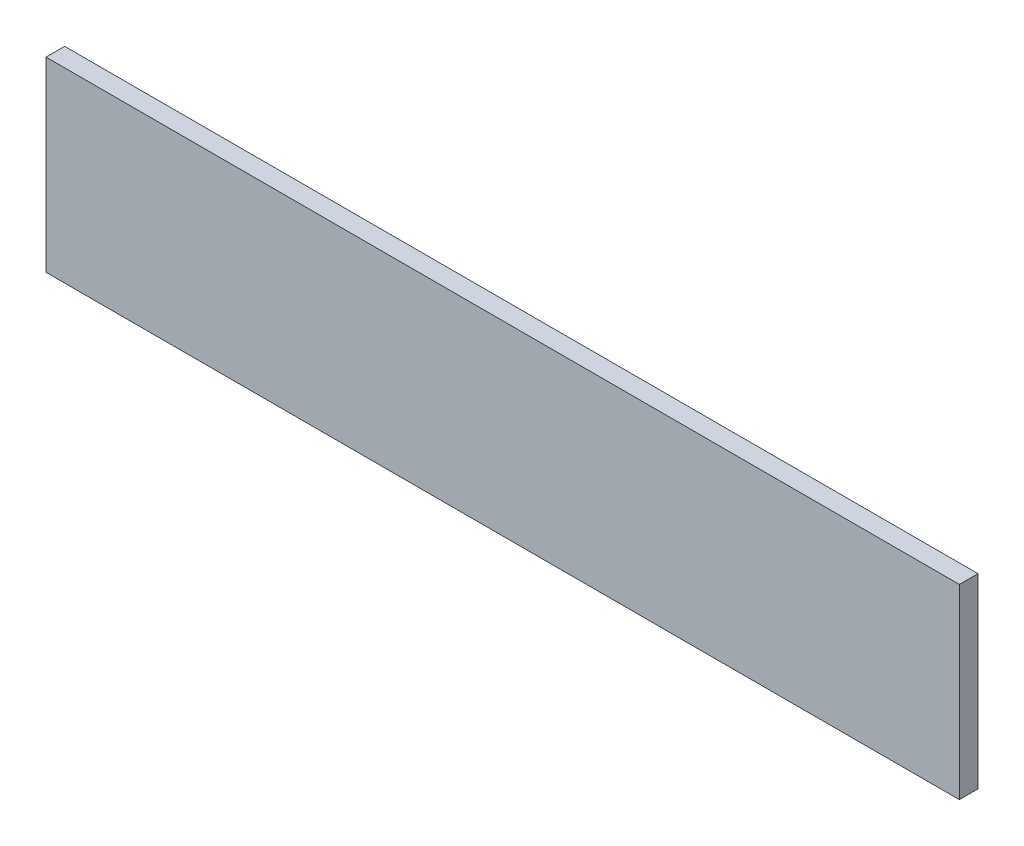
ISO-10303-21;
HEADER;
FILE_DESCRIPTION(('STEP AP214'),'2;1');
FILE_NAME('part.step','',(''),(''),'','','');
FILE_SCHEMA(('AUTOMOTIVE_DESIGN { 1 0 10303 214 1 1 1 1 }'));
ENDSEC;
DATA;
#1=APPLICATION_CONTEXT('core data for automotive mechanical design processes');
#2=APPLICATION_PROTOCOL_DEFINITION('international standard','automotive_design',2000,#1);
#3=PRODUCT_CONTEXT('',#1,'mechanical');
#4=PRODUCT('Part','Part','',(#3));
#5=PRODUCT_RELATED_PRODUCT_CATEGORY('part','',(#4));
#6=PRODUCT_DEFINITION_FORMATION('','',#4);
#7=PRODUCT_DEFINITION_CONTEXT('part definition',#1,'design');
#8=PRODUCT_DEFINITION('design','',#6,#7);
#9=PRODUCT_DEFINITION_SHAPE('','',#8);
#10=(LENGTH_UNIT() NAMED_UNIT(*) SI_UNIT(.MILLI.,.METRE.));
#11=(NAMED_UNIT(*) PLANE_ANGLE_UNIT() SI_UNIT($,.RADIAN.));
#12=(NAMED_UNIT(*) SI_UNIT($,.STERADIAN.) SOLID_ANGLE_UNIT());
#13=UNCERTAINTY_MEASURE_WITH_UNIT(LENGTH_MEASURE(1.E-05),#10,'distance_accuracy_value','');
#14=(GEOMETRIC_REPRESENTATION_CONTEXT(3) GLOBAL_UNCERTAINTY_ASSIGNED_CONTEXT((#13)) GLOBAL_UNIT_ASSIGNED_CONTEXT((#10,
#11,#12)) REPRESENTATION_CONTEXT('',''));
#15=CARTESIAN_POINT('',(0.,0.,0.));
#16=DIRECTION('',(0.,0.,1.));
#17=DIRECTION('',(1.,0.,0.));
#18=AXIS2_PLACEMENT_3D('',#15,#16,#17);
#19=CARTESIAN_POINT('',(245.,50.,10.));
#20=DIRECTION('',(-1.,0.,0.));
#21=DIRECTION('',(0.,0.,1.));
#22=AXIS2_PLACEMENT_3D('',#19,#20,#21);
#23=PLANE('',#22);
#24=DIRECTION('',(0.,1.,0.));
#25=VECTOR('',#24,1.);
#26=CARTESIAN_POINT('',(245.,50.,0.));
#27=LINE('',#26,#25);
#28=CARTESIAN_POINT('',(245.,-50.,0.));
#29=VERTEX_POINT('',#28);
#30=CARTESIAN_POINT('',(245.,50.,0.));
#31=VERTEX_POINT('',#30);
#32=EDGE_CURVE('E107',#29,#31,#27,.T.);
#33=ORIENTED_EDGE('',*,*,#32,.T.);
#34=DIRECTION('',(0.,0.,-1.));
#35=VECTOR('',#34,1.);
#36=CARTESIAN_POINT('',(245.,50.,10.));
#37=LINE('',#36,#35);
#38=CARTESIAN_POINT('',(245.,50.,10.));
#39=VERTEX_POINT('',#38);
#40=EDGE_CURVE('E11',#39,#31,#37,.T.);
#41=ORIENTED_EDGE('',*,*,#40,.F.);
#42=DIRECTION('',(0.,1.,0.));
#43=VECTOR('',#42,1.);
#44=CARTESIAN_POINT('',(245.,50.,10.));
#45=LINE('',#44,#43);
#46=CARTESIAN_POINT('',(245.,-50.,10.));
#47=VERTEX_POINT('',#46);
#48=EDGE_CURVE('E91',#47,#39,#45,.T.);
#49=ORIENTED_EDGE('',*,*,#48,.F.);
#50=DIRECTION('',(0.,0.,-1.));
#51=VECTOR('',#50,1.);
#52=CARTESIAN_POINT('',(245.,-50.,10.));
#53=LINE('',#52,#51);
#54=EDGE_CURVE('E103',#47,#29,#53,.T.);
#55=ORIENTED_EDGE('',*,*,#54,.T.);
#56=EDGE_LOOP('',(#33,#41,#49,#55));
#57=FACE_BOUND('',#56,.T.);
#58=ADVANCED_FACE('F39',(#57),#23,.F.);
#59=CARTESIAN_POINT('',(-245.,50.,10.));
#60=DIRECTION('',(0.,-1.,0.));
#61=DIRECTION('',(0.,0.,-1.));
#62=AXIS2_PLACEMENT_3D('',#59,#60,#61);
#63=PLANE('',#62);
#64=DIRECTION('',(-1.,0.,0.));
#65=VECTOR('',#64,1.);
#66=CARTESIAN_POINT('',(-245.,50.,0.));
#67=LINE('',#66,#65);
#68=CARTESIAN_POINT('',(-245.,50.,0.));
#69=VERTEX_POINT('',#68);
#70=EDGE_CURVE('E96',#31,#69,#67,.T.);
#71=ORIENTED_EDGE('',*,*,#70,.T.);
#72=DIRECTION('',(0.,0.,-1.));
#73=VECTOR('',#72,1.);
#74=CARTESIAN_POINT('',(-245.,50.,10.));
#75=LINE('',#74,#73);
#76=CARTESIAN_POINT('',(-245.,50.,10.));
#77=VERTEX_POINT('',#76);
#78=EDGE_CURVE('E48',#77,#69,#75,.T.);
#79=ORIENTED_EDGE('',*,*,#78,.F.);
#80=DIRECTION('',(-1.,0.,0.));
#81=VECTOR('',#80,1.);
#82=CARTESIAN_POINT('',(-245.,50.,10.));
#83=LINE('',#82,#81);
#84=EDGE_CURVE('E86',#39,#77,#83,.T.);
#85=ORIENTED_EDGE('',*,*,#84,.F.);
#86=ORIENTED_EDGE('',*,*,#40,.T.);
#87=EDGE_LOOP('',(#71,#79,#85,#86));
#88=FACE_BOUND('',#87,.T.);
#89=ADVANCED_FACE('F95',(#88),#63,.F.);
#90=CARTESIAN_POINT('',(-245.,50.,10.));
#91=DIRECTION('',(1.,0.,0.));
#92=DIRECTION('',(0.,0.,-1.));
#93=AXIS2_PLACEMENT_3D('',#90,#91,#92);
#94=PLANE('',#93);
#95=DIRECTION('',(0.,-1.,0.));
#96=VECTOR('',#95,1.);
#97=CARTESIAN_POINT('',(-245.,50.,0.));
#98=LINE('',#97,#96);
#99=CARTESIAN_POINT('',(-245.,-50.,0.));
#100=VERTEX_POINT('',#99);
#101=EDGE_CURVE('E73',#69,#100,#98,.T.);
#102=ORIENTED_EDGE('',*,*,#101,.T.);
#103=DIRECTION('',(0.,0.,-1.));
#104=VECTOR('',#103,1.);
#105=CARTESIAN_POINT('',(-245.,-50.,10.));
#106=LINE('',#105,#104);
#107=CARTESIAN_POINT('',(-245.,-50.,10.));
#108=VERTEX_POINT('',#107);
#109=EDGE_CURVE('E98',#108,#100,#106,.T.);
#110=ORIENTED_EDGE('',*,*,#109,.F.);
#111=DIRECTION('',(0.,-1.,0.));
#112=VECTOR('',#111,1.);
#113=CARTESIAN_POINT('',(-245.,50.,10.));
#114=LINE('',#113,#112);
#115=EDGE_CURVE('E89',#77,#108,#114,.T.);
#116=ORIENTED_EDGE('',*,*,#115,.F.);
#117=ORIENTED_EDGE('',*,*,#78,.T.);
#118=EDGE_LOOP('',(#102,#110,#116,#117));
#119=FACE_BOUND('',#118,.T.);
#120=ADVANCED_FACE('F99',(#119),#94,.F.);
#121=CARTESIAN_POINT('',(-245.,-50.,10.));
#122=DIRECTION('',(0.,1.,0.));
#123=DIRECTION('',(0.,0.,1.));
#124=AXIS2_PLACEMENT_3D('',#121,#122,#123);
#125=PLANE('',#124);
#126=DIRECTION('',(1.,0.,0.));
#127=VECTOR('',#126,1.);
#128=CARTESIAN_POINT('',(-245.,-50.,0.));
#129=LINE('',#128,#127);
#130=EDGE_CURVE('E79',#100,#29,#129,.T.);
#131=ORIENTED_EDGE('',*,*,#130,.T.);
#132=ORIENTED_EDGE('',*,*,#54,.F.);
#133=DIRECTION('',(1.,0.,0.));
#134=VECTOR('',#133,1.);
#135=CARTESIAN_POINT('',(-245.,-50.,10.));
#136=LINE('',#135,#134);
#137=EDGE_CURVE('E56',#108,#47,#136,.T.);
#138=ORIENTED_EDGE('',*,*,#137,.F.);
#139=ORIENTED_EDGE('',*,*,#109,.T.);
#140=EDGE_LOOP('',(#131,#132,#138,#139));
#141=FACE_BOUND('',#140,.T.);
#142=ADVANCED_FACE('F120',(#141),#125,.F.);
#143=CARTESIAN_POINT('',(0.,0.,10.));
#144=DIRECTION('',(0.,0.,1.));
#145=DIRECTION('',(1.,0.,0.));
#146=AXIS2_PLACEMENT_3D('',#143,#144,#145);
#147=PLANE('',#146);
#148=ORIENTED_EDGE('',*,*,#48,.T.);
#149=ORIENTED_EDGE('',*,*,#84,.T.);
#150=ORIENTED_EDGE('',*,*,#115,.T.);
#151=ORIENTED_EDGE('',*,*,#137,.T.);
#152=EDGE_LOOP('',(#148,#149,#150,#151));
#153=FACE_BOUND('',#152,.T.);
#154=ADVANCED_FACE('F87',(#153),#147,.T.);
#155=CARTESIAN_POINT('',(0.,0.,0.));
#156=DIRECTION('',(0.,0.,1.));
#157=DIRECTION('',(1.,0.,0.));
#158=AXIS2_PLACEMENT_3D('',#155,#156,#157);
#159=PLANE('',#158);
#160=ORIENTED_EDGE('',*,*,#32,.F.);
#161=ORIENTED_EDGE('',*,*,#130,.F.);
#162=ORIENTED_EDGE('',*,*,#101,.F.);
#163=ORIENTED_EDGE('',*,*,#70,.F.);
#164=EDGE_LOOP('',(#160,#161,#162,#163));
#165=FACE_BOUND('',#164,.T.);
#166=ADVANCED_FACE('F123',(#165),#159,.F.);
#167=CLOSED_SHELL('',(#58,#89,#120,#142,#154,#166));
#168=MANIFOLD_SOLID_BREP('B2',#167);
#169=ADVANCED_BREP_SHAPE_REPRESENTATION('',(#18,#168),#14);
#170=SHAPE_DEFINITION_REPRESENTATION(#9,#169);
ENDSEC;
END-ISO-10303-21;
